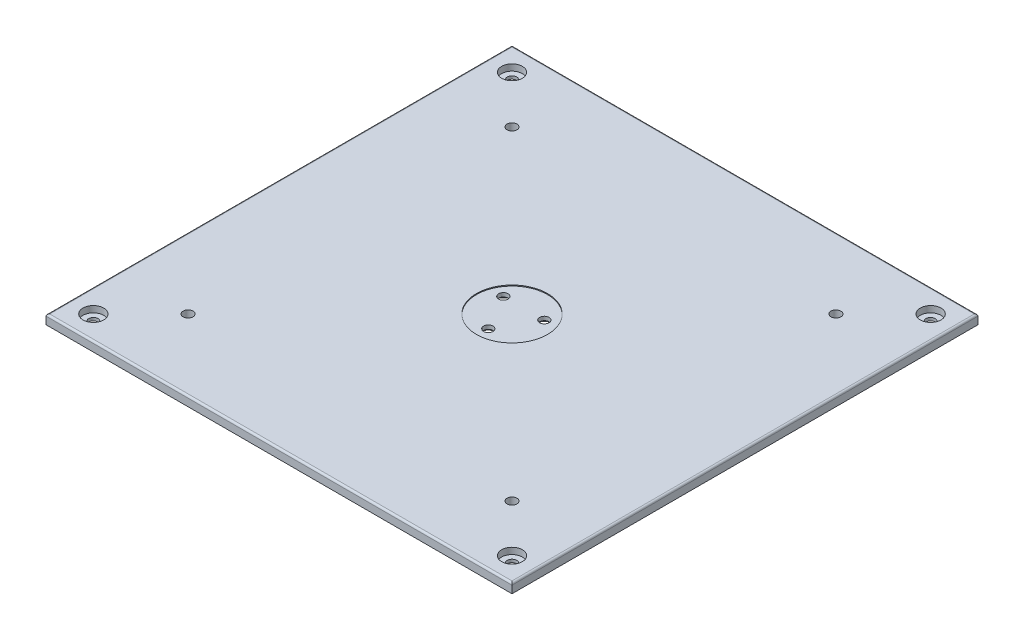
from build123d import *

# Parameters (mm, degrees)
SKETCH1_W                                           = 500
SKETCH1_H                                           = 500
BOSS_EXTRUDE1_DEPTH                                 = 10
FILLET1_R                                           = 2
SKETCH2_R                                           = 38.1
CUT_EXTRUDE1_DEPTH                                  = 1
CSK_FOR_3_8_FLAT_HEAD_MACHINE_SCREW_100_D           = 10.0838
CSK_FOR_3_8_FLAT_HEAD_MACHINE_SCREW_100_CSINK_D     = 21.7383106
CSK_FOR_3_8_FLAT_HEAD_MACHINE_SCREW_100_CSINK_ANGLE = 100
CIRPATTERN1_COUNT                                   = 3
CBORE_FOR_3_8_HEX_HEAD_BOLT1_D                      = 10.0838
CBORE_FOR_3_8_HEX_HEAD_BOLT1_CBORE_D                = 22.225
CBORE_FOR_3_8_HEX_HEAD_BOLT1_CBORE_DEPTH            = 6.8072
CIRPATTERN2_COUNT                                   = 4
F_1_2_13_TAPPED_HOLE1_D                             = 10.71626
CIRPATTERN3_COUNT                                   = 4


with BuildPart() as part:
    # Sketch1 → Boss-Extrude1 (new body)
    with BuildSketch(Plane(origin=(0, 0, 0), x_dir=(1, 0, 0), z_dir=(0, 1, 0))):
        with Locations((213.164299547, -223.52754675)):
            Rectangle(SKETCH1_W, SKETCH1_H)
    extrude(amount=BOSS_EXTRUDE1_DEPTH)

    # Fillet1
    fillet1_edges = [part.edges().sort_by_distance(p)[0] for p in [
        (463.164299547, 10, 223.52754675),
        (213.164299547, 10, -26.47245325),
        (-36.835700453, 10, 223.52754675),
        (213.164299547, 10, 473.52754675),
    ]]
    fillet(fillet1_edges, radius=FILLET1_R)

    # Sketch2 → Cut-Extrude1 (cut)
    with BuildSketch(Plane(origin=(0, 10, 0), x_dir=(1, 0, 0), z_dir=(0, 1, 0))):
        with Locations(Location((213.164299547, -223.52754675, 0), (0, 0, 270))):
            Circle(SKETCH2_R)
    extrude(amount=-CUT_EXTRUDE1_DEPTH, mode=Mode.SUBTRACT)

    # CSK for 3_8 Flat Head Machine Screw _100 (through all)
    with Locations(Plane.XZ):
        with Locations((213.164299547, 248.92754675)):
            csk_for_3_8_flat_head_machine_screw_100 = CounterSinkHole(CSK_FOR_3_8_FLAT_HEAD_MACHINE_SCREW_100_D / 2, CSK_FOR_3_8_FLAT_HEAD_MACHINE_SCREW_100_CSINK_D / 2, counter_sink_angle=CSK_FOR_3_8_FLAT_HEAD_MACHINE_SCREW_100_CSINK_ANGLE)

    # CirPattern1: CSK for 3_8 Flat Head Machine Screw _100 ×3 about axis
    cirpattern1_axis = Axis((213.164299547, 0, 223.52754675), (0, 1, 0))
    for i in range(1, CIRPATTERN1_COUNT):
        add(csk_for_3_8_flat_head_machine_screw_100.rotate(cirpattern1_axis, i * 360 / CIRPATTERN1_COUNT), mode=Mode.SUBTRACT)

    # CBORE for 3_8 Hex Head Bolt1 (through all)
    with Locations(Plane(origin=(0, 10, 0), x_dir=(-1, 0, 0), z_dir=(0, 1, 0))):
        with Locations((11.435700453, -1.07245325)):
            cbore_for_3_8_hex_head_bolt1 = CounterBoreHole(CBORE_FOR_3_8_HEX_HEAD_BOLT1_D / 2, CBORE_FOR_3_8_HEX_HEAD_BOLT1_CBORE_D / 2, CBORE_FOR_3_8_HEX_HEAD_BOLT1_CBORE_DEPTH)

    # CirPattern2: CBORE for 3_8 Hex Head Bolt1 ×4 about axis
    cirpattern2_axis = Axis((213.164299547, 0, 223.52754675), (0, 1, 0))
    for i in range(1, CIRPATTERN2_COUNT):
        add(cbore_for_3_8_hex_head_bolt1.rotate(cirpattern2_axis, i * 360 / CIRPATTERN2_COUNT), mode=Mode.SUBTRACT)

    # 1_2-13 Tapped Hole1 (through all)
    with Locations(Plane(origin=(0, 10, 0), x_dir=(-1, 0, 0), z_dir=(0, 1, 0))):
        with Locations((-39.364299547, 49.72754675)):
            f_1_2_13_tapped_hole1 = Hole(F_1_2_13_TAPPED_HOLE1_D / 2)

    # CirPattern3: 1_2-13 Tapped Hole1 ×4 about axis
    cirpattern3_axis = Axis((213.164299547, 0, 223.52754675), (0, 1, 0))
    for i in range(1, CIRPATTERN3_COUNT):
        add(f_1_2_13_tapped_hole1.rotate(cirpattern3_axis, i * 360 / CIRPATTERN3_COUNT), mode=Mode.SUBTRACT)


solid = part.part
